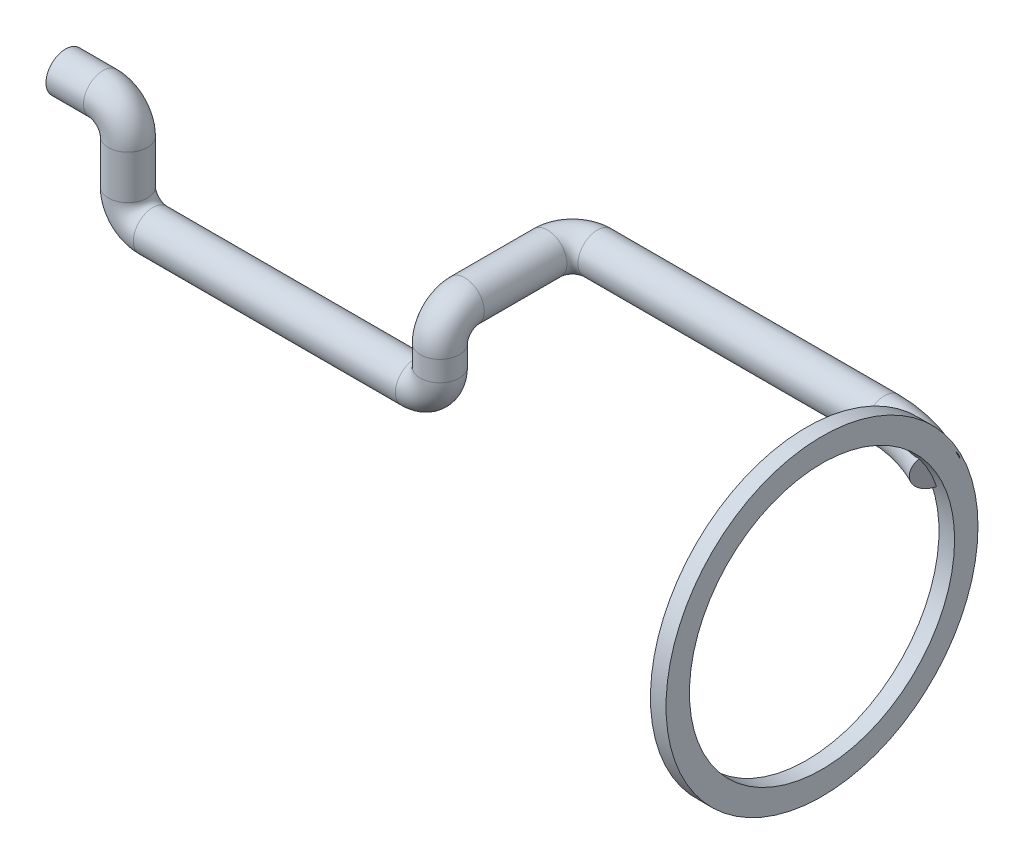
from build123d import *
from build123d.topology import SkipClean

# Parameters (mm, degrees)
SKETCH2_R           = 15.875
BOSS_EXTRUDE1_START = 603.25
SKETCH3_R           = 127
SKETCH3_R_2         = 107.95
BOSS_EXTRUDE1_DEPTH = 12.7


with BuildPart() as part:
    # Sweep2: sweep along a curve in space
    with BuildLine() as sweep2_path:
        Line((0, 0, 0), (30.48, 0, 0))
        ThreePointArc((30.48, 0, 0), (44.848409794, -5.951590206, 0), (50.8, -20.32, 0))
        Line((50.8, -20.32, 0), (50.8, -55.88, 0))
        ThreePointArc((50.8, -55.88, 0), (56.751590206, -70.248409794, 0), (71.12, -76.2, 0))
        Line((71.12, -76.2, 0), (284.48, -76.2, 0))
        ThreePointArc((284.48, -76.2, 0), (298.848409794, -70.248409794, 0), (304.8, -55.88, 0))
        Line((304.8, -55.88, 0), (304.8, -39.37, 0))
        ThreePointArc((304.8, -39.37, 0), (304.8, -25.001590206, -5.951590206), (304.8, -19.05, -20.32))
        Line((304.8, -19.05, -20.32), (304.8, -19.05, -87.63))
        ThreePointArc((304.8, -19.05, -87.63), (310.751590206, -19.05, -101.998409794), (325.12, -19.05, -107.95))
        Line((325.12, -19.05, -107.95), (558.8, -19.05, -107.95))
        ThreePointArc((609.556186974, -24.217833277, -98.188537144), (584.772019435, -20.356901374, -105.481408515), (558.8, -19.05, -107.95))
    # Sketch2 → Sweep2 (sweep)
    with BuildSketch(Plane(origin=(0, 0, 0), x_dir=(0, 0, -1), z_dir=(1, 0, 0))):
        Circle(SKETCH2_R)
    sweep(path=sweep2_path.line)

    # Sketch3 → Boss-Extrude1 (add)
    with SkipClean():  # the faces are left unmerged after this step: merging them gives an invalid solid
        with BuildSketch(Plane(origin=(0, 0, 0), x_dir=(0, 0, -1), z_dir=(1, 0, 0)).offset(BOSS_EXTRUDE1_START)):
            with Locations(Location((0, -76.2, 0), (0, 0, 32.587066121))):
                Circle(SKETCH3_R)
            with Locations(Location((0, -76.2, 0), (0, 0, 35.981614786))):
                Circle(SKETCH3_R_2, mode=Mode.SUBTRACT)
        extrude(amount=BOSS_EXTRUDE1_DEPTH)


solid = part.part
